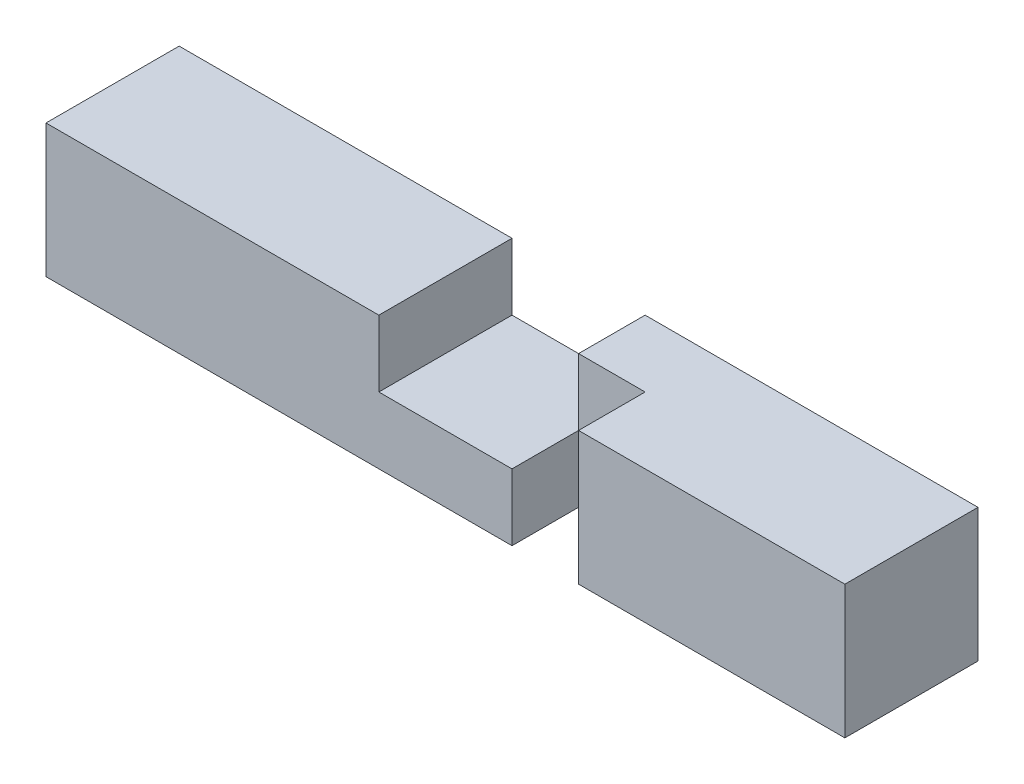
ISO-10303-21;
HEADER;
FILE_DESCRIPTION(('STEP AP214'),'2;1');
FILE_NAME('part.step','',(''),(''),'','','');
FILE_SCHEMA(('AUTOMOTIVE_DESIGN { 1 0 10303 214 1 1 1 1 }'));
ENDSEC;
DATA;
#1=APPLICATION_CONTEXT('core data for automotive mechanical design processes');
#2=APPLICATION_PROTOCOL_DEFINITION('international standard','automotive_design',2000,#1);
#3=PRODUCT_CONTEXT('',#1,'mechanical');
#4=PRODUCT('Part','Part','',(#3));
#5=PRODUCT_RELATED_PRODUCT_CATEGORY('part','',(#4));
#6=PRODUCT_DEFINITION_FORMATION('','',#4);
#7=PRODUCT_DEFINITION_CONTEXT('part definition',#1,'design');
#8=PRODUCT_DEFINITION('design','',#6,#7);
#9=PRODUCT_DEFINITION_SHAPE('','',#8);
#10=(LENGTH_UNIT() NAMED_UNIT(*) SI_UNIT(.MILLI.,.METRE.));
#11=(NAMED_UNIT(*) PLANE_ANGLE_UNIT() SI_UNIT($,.RADIAN.));
#12=(NAMED_UNIT(*) SI_UNIT($,.STERADIAN.) SOLID_ANGLE_UNIT());
#13=UNCERTAINTY_MEASURE_WITH_UNIT(LENGTH_MEASURE(1.E-05),#10,'distance_accuracy_value','');
#14=(GEOMETRIC_REPRESENTATION_CONTEXT(3) GLOBAL_UNCERTAINTY_ASSIGNED_CONTEXT((#13)) GLOBAL_UNIT_ASSIGNED_CONTEXT((#10,
#11,#12)) REPRESENTATION_CONTEXT('',''));
#15=CARTESIAN_POINT('',(0.,0.,0.));
#16=DIRECTION('',(0.,0.,1.));
#17=DIRECTION('',(1.,0.,0.));
#18=AXIS2_PLACEMENT_3D('',#15,#16,#17);
#19=CARTESIAN_POINT('',(0.,20.,0.));
#20=DIRECTION('',(0.,0.,-1.));
#21=DIRECTION('',(-1.,0.,0.));
#22=AXIS2_PLACEMENT_3D('',#19,#20,#21);
#23=PLANE('',#22);
#24=DIRECTION('',(1.,0.,0.));
#25=VECTOR('',#24,1.);
#26=CARTESIAN_POINT('',(0.,0.,0.));
#27=LINE('',#26,#25);
#28=CARTESIAN_POINT('',(0.,0.,0.));
#29=VERTEX_POINT('',#28);
#30=CARTESIAN_POINT('',(70.,0.,0.));
#31=VERTEX_POINT('',#30);
#32=EDGE_CURVE('E142',#29,#31,#27,.T.);
#33=ORIENTED_EDGE('',*,*,#32,.T.);
#34=DIRECTION('',(0.,1.,0.));
#35=VECTOR('',#34,1.);
#36=CARTESIAN_POINT('',(70.,0.,0.));
#37=LINE('',#36,#35);
#38=CARTESIAN_POINT('',(70.,10.,0.));
#39=VERTEX_POINT('',#38);
#40=EDGE_CURVE('E126',#31,#39,#37,.T.);
#41=ORIENTED_EDGE('',*,*,#40,.T.);
#42=DIRECTION('',(1.,0.,0.));
#43=VECTOR('',#42,1.);
#44=CARTESIAN_POINT('',(50.,10.,0.));
#45=LINE('',#44,#43);
#46=CARTESIAN_POINT('',(50.,10.,0.));
#47=VERTEX_POINT('',#46);
#48=EDGE_CURVE('E185',#47,#39,#45,.T.);
#49=ORIENTED_EDGE('',*,*,#48,.F.);
#50=DIRECTION('',(0.,-1.,0.));
#51=VECTOR('',#50,1.);
#52=CARTESIAN_POINT('',(50.,20.,0.));
#53=LINE('',#52,#51);
#54=CARTESIAN_POINT('',(50.,20.,0.));
#55=VERTEX_POINT('',#54);
#56=EDGE_CURVE('E213',#55,#47,#53,.T.);
#57=ORIENTED_EDGE('',*,*,#56,.F.);
#58=DIRECTION('',(1.,0.,0.));
#59=VECTOR('',#58,1.);
#60=CARTESIAN_POINT('',(0.,20.,0.));
#61=LINE('',#60,#59);
#62=CARTESIAN_POINT('',(0.,20.,0.));
#63=VERTEX_POINT('',#62);
#64=EDGE_CURVE('E84',#63,#55,#61,.T.);
#65=ORIENTED_EDGE('',*,*,#64,.F.);
#66=DIRECTION('',(0.,-1.,0.));
#67=VECTOR('',#66,1.);
#68=CARTESIAN_POINT('',(0.,20.,0.));
#69=LINE('',#68,#67);
#70=EDGE_CURVE('E11',#63,#29,#69,.T.);
#71=ORIENTED_EDGE('',*,*,#70,.T.);
#72=EDGE_LOOP('',(#33,#41,#49,#57,#65,#71));
#73=FACE_BOUND('',#72,.T.);
#74=ADVANCED_FACE('F31',(#73),#23,.F.);
#75=CARTESIAN_POINT('',(0.,20.,-20.));
#76=DIRECTION('',(0.,-1.,0.));
#77=DIRECTION('',(0.,0.,-1.));
#78=AXIS2_PLACEMENT_3D('',#75,#76,#77);
#79=PLANE('',#78);
#80=ORIENTED_EDGE('',*,*,#64,.T.);
#81=DIRECTION('',(0.,0.,1.));
#82=VECTOR('',#81,1.);
#83=CARTESIAN_POINT('',(50.,20.,-20.));
#84=LINE('',#83,#82);
#85=CARTESIAN_POINT('',(50.,20.,-20.));
#86=VERTEX_POINT('',#85);
#87=EDGE_CURVE('E176',#86,#55,#84,.T.);
#88=ORIENTED_EDGE('',*,*,#87,.F.);
#89=DIRECTION('',(-1.,0.,0.));
#90=VECTOR('',#89,1.);
#91=CARTESIAN_POINT('',(0.,20.,-20.));
#92=LINE('',#91,#90);
#93=CARTESIAN_POINT('',(0.,20.,-20.));
#94=VERTEX_POINT('',#93);
#95=EDGE_CURVE('E55',#86,#94,#92,.T.);
#96=ORIENTED_EDGE('',*,*,#95,.T.);
#97=DIRECTION('',(0.,0.,1.));
#98=VECTOR('',#97,1.);
#99=CARTESIAN_POINT('',(0.,20.,0.));
#100=LINE('',#99,#98);
#101=EDGE_CURVE('E159',#94,#63,#100,.T.);
#102=ORIENTED_EDGE('',*,*,#101,.T.);
#103=EDGE_LOOP('',(#80,#88,#96,#102));
#104=FACE_BOUND('',#103,.T.);
#105=ADVANCED_FACE('F223',(#104),#79,.F.);
#106=CARTESIAN_POINT('',(0.,20.,0.));
#107=DIRECTION('',(1.,0.,0.));
#108=DIRECTION('',(0.,0.,-1.));
#109=AXIS2_PLACEMENT_3D('',#106,#107,#108);
#110=PLANE('',#109);
#111=DIRECTION('',(0.,0.,1.));
#112=VECTOR('',#111,1.);
#113=CARTESIAN_POINT('',(0.,0.,0.));
#114=LINE('',#113,#112);
#115=CARTESIAN_POINT('',(0.,0.,-20.));
#116=VERTEX_POINT('',#115);
#117=EDGE_CURVE('E154',#116,#29,#114,.T.);
#118=ORIENTED_EDGE('',*,*,#117,.T.);
#119=ORIENTED_EDGE('',*,*,#70,.F.);
#120=ORIENTED_EDGE('',*,*,#101,.F.);
#121=DIRECTION('',(0.,-1.,0.));
#122=VECTOR('',#121,1.);
#123=CARTESIAN_POINT('',(0.,20.,-20.));
#124=LINE('',#123,#122);
#125=EDGE_CURVE('E160',#94,#116,#124,.T.);
#126=ORIENTED_EDGE('',*,*,#125,.T.);
#127=EDGE_LOOP('',(#118,#119,#120,#126));
#128=FACE_BOUND('',#127,.T.);
#129=ADVANCED_FACE('F33',(#128),#110,.F.);
#130=CARTESIAN_POINT('',(80.,20.,0.));
#131=VERTEX_POINT('',#130);
#132=CARTESIAN_POINT('',(120.,20.,0.));
#133=VERTEX_POINT('',#132);
#134=EDGE_CURVE('E194',#131,#133,#61,.T.);
#135=ORIENTED_EDGE('',*,*,#134,.F.);
#136=DIRECTION('',(0.,1.,0.));
#137=VECTOR('',#136,1.);
#138=CARTESIAN_POINT('',(80.,0.,0.));
#139=LINE('',#138,#137);
#140=CARTESIAN_POINT('',(80.,0.,0.));
#141=VERTEX_POINT('',#140);
#142=EDGE_CURVE('E136',#141,#131,#139,.T.);
#143=ORIENTED_EDGE('',*,*,#142,.F.);
#144=CARTESIAN_POINT('',(120.,0.,0.));
#145=VERTEX_POINT('',#144);
#146=EDGE_CURVE('E151',#141,#145,#27,.T.);
#147=ORIENTED_EDGE('',*,*,#146,.T.);
#148=DIRECTION('',(0.,-1.,0.));
#149=VECTOR('',#148,1.);
#150=CARTESIAN_POINT('',(120.,20.,0.));
#151=LINE('',#150,#149);
#152=EDGE_CURVE('E39',#133,#145,#151,.T.);
#153=ORIENTED_EDGE('',*,*,#152,.F.);
#154=EDGE_LOOP('',(#135,#143,#147,#153));
#155=FACE_BOUND('',#154,.T.);
#156=ADVANCED_FACE('F226',(#155),#23,.F.);
#157=CARTESIAN_POINT('',(120.,20.,0.));
#158=DIRECTION('',(-1.,0.,0.));
#159=DIRECTION('',(0.,0.,1.));
#160=AXIS2_PLACEMENT_3D('',#157,#158,#159);
#161=PLANE('',#160);
#162=DIRECTION('',(0.,0.,-1.));
#163=VECTOR('',#162,1.);
#164=CARTESIAN_POINT('',(120.,0.,0.));
#165=LINE('',#164,#163);
#166=CARTESIAN_POINT('',(120.,0.,-20.));
#167=VERTEX_POINT('',#166);
#168=EDGE_CURVE('E150',#145,#167,#165,.T.);
#169=ORIENTED_EDGE('',*,*,#168,.T.);
#170=DIRECTION('',(0.,-1.,0.));
#171=VECTOR('',#170,1.);
#172=CARTESIAN_POINT('',(120.,20.,-20.));
#173=LINE('',#172,#171);
#174=CARTESIAN_POINT('',(120.,20.,-20.));
#175=VERTEX_POINT('',#174);
#176=EDGE_CURVE('E162',#175,#167,#173,.T.);
#177=ORIENTED_EDGE('',*,*,#176,.F.);
#178=DIRECTION('',(0.,0.,-1.));
#179=VECTOR('',#178,1.);
#180=CARTESIAN_POINT('',(120.,20.,0.));
#181=LINE('',#180,#179);
#182=EDGE_CURVE('E171',#133,#175,#181,.T.);
#183=ORIENTED_EDGE('',*,*,#182,.F.);
#184=ORIENTED_EDGE('',*,*,#152,.T.);
#185=EDGE_LOOP('',(#169,#177,#183,#184));
#186=FACE_BOUND('',#185,.T.);
#187=ADVANCED_FACE('F169',(#186),#161,.F.);
#188=CARTESIAN_POINT('',(0.,20.,-20.));
#189=DIRECTION('',(0.,0.,1.));
#190=DIRECTION('',(1.,0.,0.));
#191=AXIS2_PLACEMENT_3D('',#188,#189,#190);
#192=PLANE('',#191);
#193=ORIENTED_EDGE('',*,*,#95,.F.);
#194=DIRECTION('',(0.,-1.,0.));
#195=VECTOR('',#194,1.);
#196=CARTESIAN_POINT('',(50.,20.,-20.));
#197=LINE('',#196,#195);
#198=CARTESIAN_POINT('',(50.,10.,-20.));
#199=VERTEX_POINT('',#198);
#200=EDGE_CURVE('E210',#86,#199,#197,.T.);
#201=ORIENTED_EDGE('',*,*,#200,.T.);
#202=DIRECTION('',(1.,0.,0.));
#203=VECTOR('',#202,1.);
#204=CARTESIAN_POINT('',(50.,10.,-20.));
#205=LINE('',#204,#203);
#206=CARTESIAN_POINT('',(70.,10.,-20.));
#207=VERTEX_POINT('',#206);
#208=EDGE_CURVE('E207',#199,#207,#205,.T.);
#209=ORIENTED_EDGE('',*,*,#208,.T.);
#210=DIRECTION('',(0.,1.,0.));
#211=VECTOR('',#210,1.);
#212=CARTESIAN_POINT('',(70.,20.,-20.));
#213=LINE('',#212,#211);
#214=CARTESIAN_POINT('',(70.,20.,-20.));
#215=VERTEX_POINT('',#214);
#216=EDGE_CURVE('E192',#207,#215,#213,.T.);
#217=ORIENTED_EDGE('',*,*,#216,.T.);
#218=EDGE_CURVE('E163',#175,#215,#92,.T.);
#219=ORIENTED_EDGE('',*,*,#218,.F.);
#220=ORIENTED_EDGE('',*,*,#176,.T.);
#221=DIRECTION('',(-1.,0.,0.));
#222=VECTOR('',#221,1.);
#223=CARTESIAN_POINT('',(0.,0.,-20.));
#224=LINE('',#223,#222);
#225=EDGE_CURVE('E77',#167,#116,#224,.T.);
#226=ORIENTED_EDGE('',*,*,#225,.T.);
#227=ORIENTED_EDGE('',*,*,#125,.F.);
#228=EDGE_LOOP('',(#193,#201,#209,#217,#219,#220,#226,#227));
#229=FACE_BOUND('',#228,.T.);
#230=ADVANCED_FACE('F202',(#229),#192,.F.);
#231=DIRECTION('',(0.,0.,1.));
#232=VECTOR('',#231,1.);
#233=CARTESIAN_POINT('',(70.,20.,-20.));
#234=LINE('',#233,#232);
#235=CARTESIAN_POINT('',(70.,20.,-10.));
#236=VERTEX_POINT('',#235);
#237=EDGE_CURVE('E177',#215,#236,#234,.T.);
#238=ORIENTED_EDGE('',*,*,#237,.T.);
#239=DIRECTION('',(-1.,0.,0.));
#240=VECTOR('',#239,1.);
#241=CARTESIAN_POINT('',(70.,20.,-10.));
#242=LINE('',#241,#240);
#243=CARTESIAN_POINT('',(80.,20.,-10.));
#244=VERTEX_POINT('',#243);
#245=EDGE_CURVE('E146',#244,#236,#242,.T.);
#246=ORIENTED_EDGE('',*,*,#245,.F.);
#247=DIRECTION('',(0.,0.,-1.));
#248=VECTOR('',#247,1.);
#249=CARTESIAN_POINT('',(80.,20.,0.));
#250=LINE('',#249,#248);
#251=EDGE_CURVE('E265',#131,#244,#250,.T.);
#252=ORIENTED_EDGE('',*,*,#251,.F.);
#253=ORIENTED_EDGE('',*,*,#134,.T.);
#254=ORIENTED_EDGE('',*,*,#182,.T.);
#255=ORIENTED_EDGE('',*,*,#218,.T.);
#256=EDGE_LOOP('',(#238,#246,#252,#253,#254,#255));
#257=FACE_BOUND('',#256,.T.);
#258=ADVANCED_FACE('F199',(#257),#79,.F.);
#259=CARTESIAN_POINT('',(0.,0.,-20.));
#260=DIRECTION('',(0.,-1.,0.));
#261=DIRECTION('',(0.,0.,-1.));
#262=AXIS2_PLACEMENT_3D('',#259,#260,#261);
#263=PLANE('',#262);
#264=DIRECTION('',(0.,0.,1.));
#265=VECTOR('',#264,1.);
#266=CARTESIAN_POINT('',(70.,0.,0.));
#267=LINE('',#266,#265);
#268=CARTESIAN_POINT('',(70.,0.,-10.));
#269=VERTEX_POINT('',#268);
#270=EDGE_CURVE('E129',#269,#31,#267,.T.);
#271=ORIENTED_EDGE('',*,*,#270,.T.);
#272=ORIENTED_EDGE('',*,*,#32,.F.);
#273=ORIENTED_EDGE('',*,*,#117,.F.);
#274=ORIENTED_EDGE('',*,*,#225,.F.);
#275=ORIENTED_EDGE('',*,*,#168,.F.);
#276=ORIENTED_EDGE('',*,*,#146,.F.);
#277=DIRECTION('',(0.,0.,-1.));
#278=VECTOR('',#277,1.);
#279=CARTESIAN_POINT('',(80.,0.,0.));
#280=LINE('',#279,#278);
#281=CARTESIAN_POINT('',(80.,0.,-10.));
#282=VERTEX_POINT('',#281);
#283=EDGE_CURVE('E145',#141,#282,#280,.T.);
#284=ORIENTED_EDGE('',*,*,#283,.T.);
#285=DIRECTION('',(-1.,0.,0.));
#286=VECTOR('',#285,1.);
#287=CARTESIAN_POINT('',(70.,0.,-10.));
#288=LINE('',#287,#286);
#289=EDGE_CURVE('E137',#282,#269,#288,.T.);
#290=ORIENTED_EDGE('',*,*,#289,.T.);
#291=EDGE_LOOP('',(#271,#272,#273,#274,#275,#276,#284,#290));
#292=FACE_BOUND('',#291,.T.);
#293=ADVANCED_FACE('F140',(#292),#263,.T.);
#294=CARTESIAN_POINT('',(50.,20.,-20.));
#295=DIRECTION('',(-1.,0.,0.));
#296=DIRECTION('',(0.,0.,1.));
#297=AXIS2_PLACEMENT_3D('',#294,#295,#296);
#298=PLANE('',#297);
#299=ORIENTED_EDGE('',*,*,#56,.T.);
#300=DIRECTION('',(0.,0.,1.));
#301=VECTOR('',#300,1.);
#302=CARTESIAN_POINT('',(50.,10.,-20.));
#303=LINE('',#302,#301);
#304=EDGE_CURVE('E190',#199,#47,#303,.T.);
#305=ORIENTED_EDGE('',*,*,#304,.F.);
#306=ORIENTED_EDGE('',*,*,#200,.F.);
#307=ORIENTED_EDGE('',*,*,#87,.T.);
#308=EDGE_LOOP('',(#299,#305,#306,#307));
#309=FACE_BOUND('',#308,.T.);
#310=ADVANCED_FACE('F222',(#309),#298,.F.);
#311=CARTESIAN_POINT('',(70.,20.,-20.));
#312=DIRECTION('',(1.,0.,0.));
#313=DIRECTION('',(0.,0.,-1.));
#314=AXIS2_PLACEMENT_3D('',#311,#312,#313);
#315=PLANE('',#314);
#316=DIRECTION('',(0.,0.,1.));
#317=VECTOR('',#316,1.);
#318=CARTESIAN_POINT('',(70.,10.,-20.));
#319=LINE('',#318,#317);
#320=CARTESIAN_POINT('',(70.,10.,-10.));
#321=VERTEX_POINT('',#320);
#322=EDGE_CURVE('E182',#207,#321,#319,.T.);
#323=ORIENTED_EDGE('',*,*,#322,.T.);
#324=DIRECTION('',(0.,1.,0.));
#325=VECTOR('',#324,1.);
#326=CARTESIAN_POINT('',(70.,0.,-10.));
#327=LINE('',#326,#325);
#328=EDGE_CURVE('E214',#321,#236,#327,.T.);
#329=ORIENTED_EDGE('',*,*,#328,.T.);
#330=ORIENTED_EDGE('',*,*,#237,.F.);
#331=ORIENTED_EDGE('',*,*,#216,.F.);
#332=EDGE_LOOP('',(#323,#329,#330,#331));
#333=FACE_BOUND('',#332,.T.);
#334=ADVANCED_FACE('F245',(#333),#315,.F.);
#335=CARTESIAN_POINT('',(50.,10.,-20.));
#336=DIRECTION('',(0.,-1.,0.));
#337=DIRECTION('',(0.,0.,-1.));
#338=AXIS2_PLACEMENT_3D('',#335,#336,#337);
#339=PLANE('',#338);
#340=ORIENTED_EDGE('',*,*,#48,.T.);
#341=EDGE_CURVE('E132',#321,#39,#319,.T.);
#342=ORIENTED_EDGE('',*,*,#341,.F.);
#343=ORIENTED_EDGE('',*,*,#322,.F.);
#344=ORIENTED_EDGE('',*,*,#208,.F.);
#345=ORIENTED_EDGE('',*,*,#304,.T.);
#346=EDGE_LOOP('',(#340,#342,#343,#344,#345));
#347=FACE_BOUND('',#346,.T.);
#348=ADVANCED_FACE('F246',(#347),#339,.F.);
#349=CARTESIAN_POINT('',(70.,0.,0.));
#350=DIRECTION('',(-1.,0.,0.));
#351=DIRECTION('',(0.,0.,1.));
#352=AXIS2_PLACEMENT_3D('',#349,#350,#351);
#353=PLANE('',#352);
#354=ORIENTED_EDGE('',*,*,#40,.F.);
#355=ORIENTED_EDGE('',*,*,#270,.F.);
#356=EDGE_CURVE('E46',#269,#321,#327,.T.);
#357=ORIENTED_EDGE('',*,*,#356,.T.);
#358=ORIENTED_EDGE('',*,*,#341,.T.);
#359=EDGE_LOOP('',(#354,#355,#357,#358));
#360=FACE_BOUND('',#359,.T.);
#361=ADVANCED_FACE('F128',(#360),#353,.F.);
#362=CARTESIAN_POINT('',(70.,0.,-10.));
#363=DIRECTION('',(0.,0.,-1.));
#364=DIRECTION('',(-1.,0.,0.));
#365=AXIS2_PLACEMENT_3D('',#362,#363,#364);
#366=PLANE('',#365);
#367=ORIENTED_EDGE('',*,*,#245,.T.);
#368=ORIENTED_EDGE('',*,*,#328,.F.);
#369=ORIENTED_EDGE('',*,*,#356,.F.);
#370=ORIENTED_EDGE('',*,*,#289,.F.);
#371=DIRECTION('',(0.,1.,0.));
#372=VECTOR('',#371,1.);
#373=CARTESIAN_POINT('',(80.,0.,-10.));
#374=LINE('',#373,#372);
#375=EDGE_CURVE('E217',#282,#244,#374,.T.);
#376=ORIENTED_EDGE('',*,*,#375,.T.);
#377=EDGE_LOOP('',(#367,#368,#369,#370,#376));
#378=FACE_BOUND('',#377,.T.);
#379=ADVANCED_FACE('F254',(#378),#366,.F.);
#380=CARTESIAN_POINT('',(80.,0.,0.));
#381=DIRECTION('',(1.,0.,0.));
#382=DIRECTION('',(0.,0.,-1.));
#383=AXIS2_PLACEMENT_3D('',#380,#381,#382);
#384=PLANE('',#383);
#385=ORIENTED_EDGE('',*,*,#251,.T.);
#386=ORIENTED_EDGE('',*,*,#375,.F.);
#387=ORIENTED_EDGE('',*,*,#283,.F.);
#388=ORIENTED_EDGE('',*,*,#142,.T.);
#389=EDGE_LOOP('',(#385,#386,#387,#388));
#390=FACE_BOUND('',#389,.T.);
#391=ADVANCED_FACE('F255',(#390),#384,.F.);
#392=CLOSED_SHELL('',(#74,#105,#129,#156,#187,#230,#258,#293,#310,#334,#348,#361,#379,#391));
#393=MANIFOLD_SOLID_BREP('B2',#392);
#394=ADVANCED_BREP_SHAPE_REPRESENTATION('',(#18,#393),#14);
#395=SHAPE_DEFINITION_REPRESENTATION(#9,#394);
ENDSEC;
END-ISO-10303-21;
